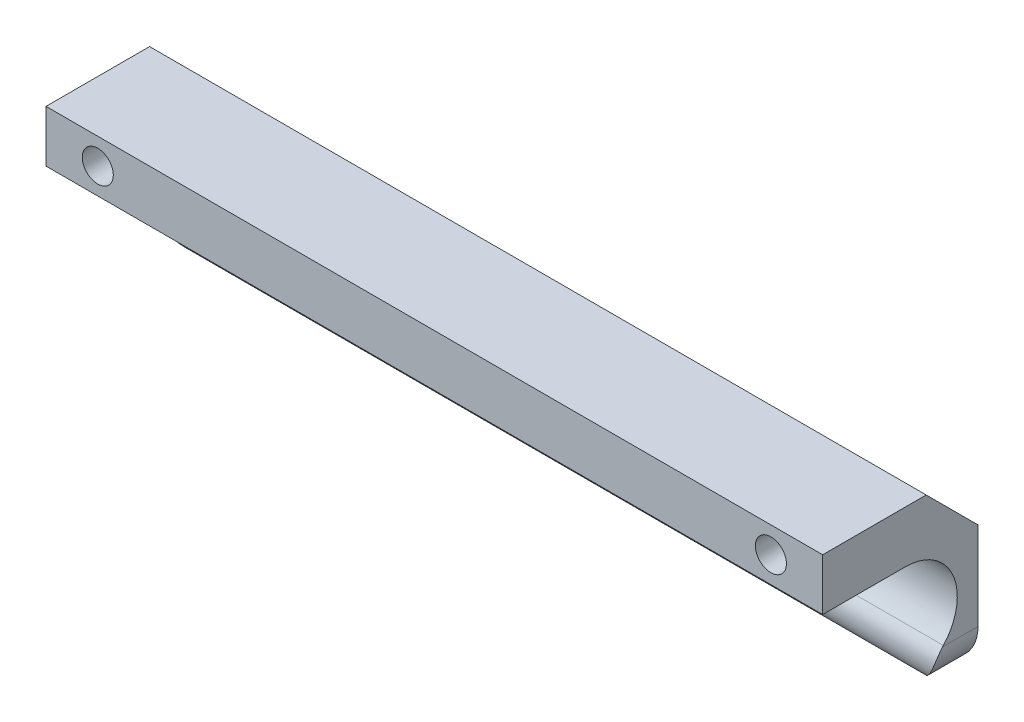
ISO-10303-21;
HEADER;
FILE_DESCRIPTION(('STEP AP214'),'2;1');
FILE_NAME('part.step','',(''),(''),'','','');
FILE_SCHEMA(('AUTOMOTIVE_DESIGN { 1 0 10303 214 1 1 1 1 }'));
ENDSEC;
DATA;
#1=APPLICATION_CONTEXT('core data for automotive mechanical design processes');
#2=APPLICATION_PROTOCOL_DEFINITION('international standard','automotive_design',2000,#1);
#3=PRODUCT_CONTEXT('',#1,'mechanical');
#4=PRODUCT('Part','Part','',(#3));
#5=PRODUCT_RELATED_PRODUCT_CATEGORY('part','',(#4));
#6=PRODUCT_DEFINITION_FORMATION('','',#4);
#7=PRODUCT_DEFINITION_CONTEXT('part definition',#1,'design');
#8=PRODUCT_DEFINITION('design','',#6,#7);
#9=PRODUCT_DEFINITION_SHAPE('','',#8);
#10=(LENGTH_UNIT() NAMED_UNIT(*) SI_UNIT(.MILLI.,.METRE.));
#11=(NAMED_UNIT(*) PLANE_ANGLE_UNIT() SI_UNIT($,.RADIAN.));
#12=(NAMED_UNIT(*) SI_UNIT($,.STERADIAN.) SOLID_ANGLE_UNIT());
#13=UNCERTAINTY_MEASURE_WITH_UNIT(LENGTH_MEASURE(1.E-05),#10,'distance_accuracy_value','');
#14=(GEOMETRIC_REPRESENTATION_CONTEXT(3) GLOBAL_UNCERTAINTY_ASSIGNED_CONTEXT((#13)) GLOBAL_UNIT_ASSIGNED_CONTEXT((#10,
#11,#12)) REPRESENTATION_CONTEXT('',''));
#15=CARTESIAN_POINT('',(0.,0.,0.));
#16=DIRECTION('',(0.,0.,1.));
#17=DIRECTION('',(1.,0.,0.));
#18=AXIS2_PLACEMENT_3D('',#15,#16,#17);
#19=CARTESIAN_POINT('',(-75.,17.5,-15.));
#20=DIRECTION('',(-1.,0.,0.));
#21=DIRECTION('',(0.,0.,1.));
#22=AXIS2_PLACEMENT_3D('',#19,#20,#21);
#23=PLANE('',#22);
#24=DIRECTION('',(0.,1.,0.));
#25=VECTOR('',#24,1.);
#26=CARTESIAN_POINT('',(-75.,-17.5,-15.));
#27=LINE('',#26,#25);
#28=CARTESIAN_POINT('',(-75.,-9.5,-15.));
#29=VERTEX_POINT('',#28);
#30=CARTESIAN_POINT('',(-75.,7.50000000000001,-15.));
#31=VERTEX_POINT('',#30);
#32=EDGE_CURVE('E204',#29,#31,#27,.T.);
#33=ORIENTED_EDGE('',*,*,#32,.F.);
#34=DIRECTION('',(0.,0.,-1.));
#35=VECTOR('',#34,1.);
#36=CARTESIAN_POINT('',(-75.,-9.5,15.));
#37=LINE('',#36,#35);
#38=CARTESIAN_POINT('',(-75.,-9.5,-8.15302564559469));
#39=VERTEX_POINT('',#38);
#40=EDGE_CURVE('E163',#39,#29,#37,.T.);
#41=ORIENTED_EDGE('',*,*,#40,.F.);
#42=CARTESIAN_POINT('',(-75.,-12.642135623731,-11.857864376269));
#43=DIRECTION('',(1.,0.,0.));
#44=DIRECTION('',(0.,0.,-1.));
#45=AXIS2_PLACEMENT_3D('',#42,#43,#44);
#46=CIRCLE('',#45,4.85786437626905);
#47=CARTESIAN_POINT('',(-75.,-9.32610593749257,-8.30782305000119));
#48=VERTEX_POINT('',#47);
#49=EDGE_CURVE('E177',#48,#39,#46,.T.);
#50=ORIENTED_EDGE('',*,*,#49,.F.);
#51=CARTESIAN_POINT('',(-75.,-2.5,-0.999999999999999));
#52=DIRECTION('',(1.,0.,0.));
#53=DIRECTION('',(0.,0.,-1.));
#54=AXIS2_PLACEMENT_3D('',#51,#52,#53);
#55=CIRCLE('',#54,10.);
#56=CARTESIAN_POINT('',(-75.,7.5,-1.));
#57=VERTEX_POINT('',#56);
#58=EDGE_CURVE('E181',#48,#57,#55,.T.);
#59=ORIENTED_EDGE('',*,*,#58,.T.);
#60=DIRECTION('',(0.,0.,1.));
#61=VECTOR('',#60,1.);
#62=CARTESIAN_POINT('',(-75.,7.5,-35.9970345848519));
#63=LINE('',#62,#61);
#64=CARTESIAN_POINT('',(-75.,7.5,15.));
#65=VERTEX_POINT('',#64);
#66=EDGE_CURVE('E186',#57,#65,#63,.T.);
#67=ORIENTED_EDGE('',*,*,#66,.T.);
#68=DIRECTION('',(0.,-1.,0.));
#69=VECTOR('',#68,1.);
#70=CARTESIAN_POINT('',(-75.,-17.5,15.));
#71=LINE('',#70,#69);
#72=CARTESIAN_POINT('',(-75.,17.5,15.));
#73=VERTEX_POINT('',#72);
#74=EDGE_CURVE('E213',#73,#65,#71,.T.);
#75=ORIENTED_EDGE('',*,*,#74,.F.);
#76=DIRECTION('',(0.,0.,1.));
#77=VECTOR('',#76,1.);
#78=CARTESIAN_POINT('',(-75.,17.5,15.));
#79=LINE('',#78,#77);
#80=CARTESIAN_POINT('',(-75.,17.5,-5.00000000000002));
#81=VERTEX_POINT('',#80);
#82=EDGE_CURVE('E223',#81,#73,#79,.T.);
#83=ORIENTED_EDGE('',*,*,#82,.F.);
#84=DIRECTION('',(0.,0.707106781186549,0.707106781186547));
#85=VECTOR('',#84,1.);
#86=CARTESIAN_POINT('',(-75.,12.5,-10.));
#87=LINE('',#86,#85);
#88=EDGE_CURVE('E236',#81,#31,#87,.F.);
#89=ORIENTED_EDGE('',*,*,#88,.T.);
#90=EDGE_LOOP('',(#33,#41,#50,#59,#67,#75,#83,#89));
#91=FACE_BOUND('',#90,.T.);
#92=ADVANCED_FACE('F37',(#91),#23,.T.);
#93=CARTESIAN_POINT('',(75.,17.5,-15.));
#94=DIRECTION('',(-1.,0.,0.));
#95=DIRECTION('',(0.,0.,1.));
#96=AXIS2_PLACEMENT_3D('',#93,#94,#95);
#97=PLANE('',#96);
#98=DIRECTION('',(0.,0.,-1.));
#99=VECTOR('',#98,1.);
#100=CARTESIAN_POINT('',(75.,-9.5,15.));
#101=LINE('',#100,#99);
#102=CARTESIAN_POINT('',(75.,-9.5,-8.15302564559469));
#103=VERTEX_POINT('',#102);
#104=CARTESIAN_POINT('',(75.,-9.5,-15.));
#105=VERTEX_POINT('',#104);
#106=EDGE_CURVE('E169',#103,#105,#101,.T.);
#107=ORIENTED_EDGE('',*,*,#106,.T.);
#108=DIRECTION('',(0.,1.,0.));
#109=VECTOR('',#108,1.);
#110=CARTESIAN_POINT('',(75.,-17.5,-15.));
#111=LINE('',#110,#109);
#112=CARTESIAN_POINT('',(75.,7.49999999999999,-15.));
#113=VERTEX_POINT('',#112);
#114=EDGE_CURVE('E209',#105,#113,#111,.T.);
#115=ORIENTED_EDGE('',*,*,#114,.T.);
#116=DIRECTION('',(0.,-0.707106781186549,-0.707106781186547));
#117=VECTOR('',#116,1.);
#118=CARTESIAN_POINT('',(75.,17.5,-5.00000000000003));
#119=LINE('',#118,#117);
#120=CARTESIAN_POINT('',(75.,17.5,-5.00000000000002));
#121=VERTEX_POINT('',#120);
#122=EDGE_CURVE('E244',#113,#121,#119,.F.);
#123=ORIENTED_EDGE('',*,*,#122,.T.);
#124=DIRECTION('',(0.,0.,1.));
#125=VECTOR('',#124,1.);
#126=CARTESIAN_POINT('',(75.,17.5,15.));
#127=LINE('',#126,#125);
#128=CARTESIAN_POINT('',(75.,17.5,15.));
#129=VERTEX_POINT('',#128);
#130=EDGE_CURVE('E212',#121,#129,#127,.T.);
#131=ORIENTED_EDGE('',*,*,#130,.T.);
#132=DIRECTION('',(0.,-1.,0.));
#133=VECTOR('',#132,1.);
#134=CARTESIAN_POINT('',(75.,-17.5,15.));
#135=LINE('',#134,#133);
#136=CARTESIAN_POINT('',(75.,7.5,15.));
#137=VERTEX_POINT('',#136);
#138=EDGE_CURVE('E216',#129,#137,#135,.T.);
#139=ORIENTED_EDGE('',*,*,#138,.T.);
#140=DIRECTION('',(0.,0.,1.));
#141=VECTOR('',#140,1.);
#142=CARTESIAN_POINT('',(75.,7.5,-35.9970345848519));
#143=LINE('',#142,#141);
#144=CARTESIAN_POINT('',(75.,7.5,-1.));
#145=VERTEX_POINT('',#144);
#146=EDGE_CURVE('E182',#145,#137,#143,.T.);
#147=ORIENTED_EDGE('',*,*,#146,.F.);
#148=CARTESIAN_POINT('',(75.,-2.5,-0.999999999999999));
#149=DIRECTION('',(1.,0.,0.));
#150=DIRECTION('',(0.,0.,-1.));
#151=AXIS2_PLACEMENT_3D('',#148,#149,#150);
#152=CIRCLE('',#151,10.);
#153=CARTESIAN_POINT('',(75.,-9.32610593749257,-8.30782305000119));
#154=VERTEX_POINT('',#153);
#155=EDGE_CURVE('E194',#154,#145,#152,.T.);
#156=ORIENTED_EDGE('',*,*,#155,.F.);
#157=CARTESIAN_POINT('',(75.,-12.642135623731,-11.857864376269));
#158=DIRECTION('',(1.,0.,0.));
#159=DIRECTION('',(0.,0.,-1.));
#160=AXIS2_PLACEMENT_3D('',#157,#158,#159);
#161=CIRCLE('',#160,4.85786437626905);
#162=EDGE_CURVE('E176',#154,#103,#161,.T.);
#163=ORIENTED_EDGE('',*,*,#162,.T.);
#164=EDGE_LOOP('',(#107,#115,#123,#131,#139,#147,#156,#163));
#165=FACE_BOUND('',#164,.T.);
#166=ADVANCED_FACE('F268',(#165),#97,.F.);
#167=CARTESIAN_POINT('',(75.,-17.5,-15.));
#168=DIRECTION('',(0.,0.,1.));
#169=DIRECTION('',(1.,0.,0.));
#170=AXIS2_PLACEMENT_3D('',#167,#168,#169);
#171=PLANE('',#170);
#172=DIRECTION('',(1.,0.,0.));
#173=VECTOR('',#172,1.);
#174=CARTESIAN_POINT('',(-75.,-16.3469743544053,-15.));
#175=LINE('',#174,#173);
#176=CARTESIAN_POINT('',(-71.1375043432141,-16.3469743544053,-15.));
#177=VERTEX_POINT('',#176);
#178=CARTESIAN_POINT('',(71.1375043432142,-16.3469743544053,-15.));
#179=VERTEX_POINT('',#178);
#180=EDGE_CURVE('E173',#177,#179,#175,.T.);
#181=ORIENTED_EDGE('',*,*,#180,.F.);
#182=CARTESIAN_POINT('',(-67.,-9.5,-15.));
#183=DIRECTION('',(0.,0.,1.));
#184=DIRECTION('',(-1.,0.,0.));
#185=AXIS2_PLACEMENT_3D('',#182,#183,#184);
#186=CIRCLE('',#185,7.99999999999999);
#187=EDGE_CURVE('E160',#29,#177,#186,.T.);
#188=ORIENTED_EDGE('',*,*,#187,.F.);
#189=ORIENTED_EDGE('',*,*,#32,.T.);
#190=DIRECTION('',(1.,0.,0.));
#191=VECTOR('',#190,1.);
#192=CARTESIAN_POINT('',(75.,7.50000000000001,-15.));
#193=LINE('',#192,#191);
#194=EDGE_CURVE('E240',#31,#113,#193,.T.);
#195=ORIENTED_EDGE('',*,*,#194,.T.);
#196=ORIENTED_EDGE('',*,*,#114,.F.);
#197=CARTESIAN_POINT('',(67.,-9.5,-15.));
#198=DIRECTION('',(0.,0.,1.));
#199=DIRECTION('',(-1.,0.,0.));
#200=AXIS2_PLACEMENT_3D('',#197,#198,#199);
#201=CIRCLE('',#200,8.);
#202=EDGE_CURVE('E166',#179,#105,#201,.T.);
#203=ORIENTED_EDGE('',*,*,#202,.F.);
#204=EDGE_LOOP('',(#181,#188,#189,#195,#196,#203));
#205=FACE_BOUND('',#204,.T.);
#206=ADVANCED_FACE('F315',(#205),#171,.F.);
#207=CARTESIAN_POINT('',(75.,17.5,15.));
#208=DIRECTION('',(0.,-1.,0.));
#209=DIRECTION('',(0.,0.,-1.));
#210=AXIS2_PLACEMENT_3D('',#207,#208,#209);
#211=PLANE('',#210);
#212=ORIENTED_EDGE('',*,*,#130,.F.);
#213=DIRECTION('',(-1.,0.,0.));
#214=VECTOR('',#213,1.);
#215=CARTESIAN_POINT('',(75.,17.5,-5.00000000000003));
#216=LINE('',#215,#214);
#217=EDGE_CURVE('E232',#121,#81,#216,.T.);
#218=ORIENTED_EDGE('',*,*,#217,.T.);
#219=ORIENTED_EDGE('',*,*,#82,.T.);
#220=DIRECTION('',(-1.,0.,0.));
#221=VECTOR('',#220,1.);
#222=CARTESIAN_POINT('',(75.,17.5,15.));
#223=LINE('',#222,#221);
#224=EDGE_CURVE('E220',#129,#73,#223,.T.);
#225=ORIENTED_EDGE('',*,*,#224,.F.);
#226=EDGE_LOOP('',(#212,#218,#219,#225));
#227=FACE_BOUND('',#226,.T.);
#228=ADVANCED_FACE('F322',(#227),#211,.F.);
#229=CARTESIAN_POINT('',(75.,-17.5,15.));
#230=DIRECTION('',(0.,0.,-1.));
#231=DIRECTION('',(-1.,0.,0.));
#232=AXIS2_PLACEMENT_3D('',#229,#230,#231);
#233=PLANE('',#232);
#234=CARTESIAN_POINT('',(65.,12.5,15.));
#235=DIRECTION('',(0.,0.,1.));
#236=DIRECTION('',(1.,0.,0.));
#237=AXIS2_PLACEMENT_3D('',#234,#235,#236);
#238=CIRCLE('',#237,3.);
#239=CARTESIAN_POINT('',(68.,12.5,15.));
#240=VERTEX_POINT('',#239);
#241=EDGE_CURVE('E354',#240,#240,#238,.T.);
#242=ORIENTED_EDGE('',*,*,#241,.F.);
#243=EDGE_LOOP('',(#242));
#244=FACE_BOUND('',#243,.T.);
#245=CARTESIAN_POINT('',(-65.,12.5,15.));
#246=DIRECTION('',(0.,0.,1.));
#247=DIRECTION('',(1.,0.,0.));
#248=AXIS2_PLACEMENT_3D('',#245,#246,#247);
#249=CIRCLE('',#248,3.);
#250=CARTESIAN_POINT('',(-62.,12.5,15.));
#251=VERTEX_POINT('',#250);
#252=EDGE_CURVE('E134',#251,#251,#249,.T.);
#253=ORIENTED_EDGE('',*,*,#252,.F.);
#254=EDGE_LOOP('',(#253));
#255=FACE_BOUND('',#254,.T.);
#256=ORIENTED_EDGE('',*,*,#74,.T.);
#257=DIRECTION('',(1.,0.,0.));
#258=VECTOR('',#257,1.);
#259=CARTESIAN_POINT('',(-75.,7.5,15.));
#260=LINE('',#259,#258);
#261=EDGE_CURVE('E200',#65,#137,#260,.T.);
#262=ORIENTED_EDGE('',*,*,#261,.T.);
#263=ORIENTED_EDGE('',*,*,#138,.F.);
#264=ORIENTED_EDGE('',*,*,#224,.T.);
#265=EDGE_LOOP('',(#256,#262,#263,#264));
#266=FACE_BOUND('',#265,.T.);
#267=ADVANCED_FACE('F319',(#244,#255,#266),#233,.F.);
#268=CARTESIAN_POINT('',(75.,17.5,-5.00000000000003));
#269=DIRECTION('',(0.,-0.707106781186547,0.707106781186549));
#270=DIRECTION('',(0.,-0.707106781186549,-0.707106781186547));
#271=AXIS2_PLACEMENT_3D('',#268,#269,#270);
#272=PLANE('',#271);
#273=ORIENTED_EDGE('',*,*,#122,.F.);
#274=ORIENTED_EDGE('',*,*,#194,.F.);
#275=ORIENTED_EDGE('',*,*,#88,.F.);
#276=ORIENTED_EDGE('',*,*,#217,.F.);
#277=EDGE_LOOP('',(#273,#274,#275,#276));
#278=FACE_BOUND('',#277,.T.);
#279=ADVANCED_FACE('F39',(#278),#272,.F.);
#280=CARTESIAN_POINT('',(-75.,-12.642135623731,-11.857864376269));
#281=DIRECTION('',(1.,0.,0.));
#282=DIRECTION('',(0.,0.,-1.));
#283=AXIS2_PLACEMENT_3D('',#280,#281,#282);
#284=CYLINDRICAL_SURFACE('',#283,4.85786437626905);
#285=CARTESIAN_POINT('',(-71.1375043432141,-16.3469743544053,-15.));
#286=CARTESIAN_POINT('',(-71.026149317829,-16.4142592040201,-14.9206561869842));
#287=CARTESIAN_POINT('',(-70.9139235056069,-16.4783721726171,-14.8399052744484));
#288=CARTESIAN_POINT('',(-70.6879480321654,-16.6003901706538,-14.6759350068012));
#289=CARTESIAN_POINT('',(-70.574198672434,-16.6582964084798,-14.5927161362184));
#290=CARTESIAN_POINT('',(-70.2311071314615,-16.8228592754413,-14.3399621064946));
#291=CARTESIAN_POINT('',(-69.9997446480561,-16.920466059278,-14.1672029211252));
#292=CARTESIAN_POINT('',(-69.5341663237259,-17.0920563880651,-13.8161969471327));
#293=CARTESIAN_POINT('',(-69.2999657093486,-17.1661334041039,-13.6379750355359));
#294=CARTESIAN_POINT('',(-68.8289391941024,-17.291943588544,-13.2772338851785));
#295=CARTESIAN_POINT('',(-68.5921135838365,-17.3436792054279,-13.0947151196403));
#296=CARTESIAN_POINT('',(-68.1319730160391,-17.422727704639,-12.7387085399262));
#297=CARTESIAN_POINT('',(-67.9087578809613,-17.4513858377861,-12.5653856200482));
#298=CARTESIAN_POINT('',(-67.4617109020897,-17.4898128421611,-12.2176471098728));
#299=CARTESIAN_POINT('',(-67.2378795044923,-17.4995929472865,-12.0432322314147));
#300=CARTESIAN_POINT('',(-67.0094068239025,-17.4999958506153,-11.8651946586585));
#301=CARTESIAN_POINT('',(-67.0047033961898,-17.4999999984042,-11.8615295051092));
#302=CARTESIAN_POINT('',(-67.,-17.5,-11.857864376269));
#303=B_SPLINE_CURVE_WITH_KNOTS('',3,(#285,#286,#287,#288,#289,#290,#291,#292,#293,#294,#295,
#296,#297,#298,#299,#300,#301,#302),.UNSPECIFIED.,.F.,.F.,(4,2,2,2,2,2,2,2,4),(0.,
0.457072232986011,0.914055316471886,1.82729816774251,2.73686646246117,3.64633504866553,
4.49789854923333,5.348955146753,5.3668436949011),.UNSPECIFIED.);
#304=CARTESIAN_POINT('',(-67.,-17.5,-11.857864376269));
#305=VERTEX_POINT('',#304);
#306=EDGE_CURVE('E11',#177,#305,#303,.T.);
#307=ORIENTED_EDGE('',*,*,#306,.F.);
#308=ORIENTED_EDGE('',*,*,#180,.T.);
#309=CARTESIAN_POINT('',(71.1375043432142,-16.3469743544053,-15.));
#310=CARTESIAN_POINT('',(71.026149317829,-16.4142592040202,-14.9206561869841));
#311=CARTESIAN_POINT('',(70.9139235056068,-16.4783721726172,-14.8399052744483));
#312=CARTESIAN_POINT('',(70.6879480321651,-16.6003901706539,-14.675935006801));
#313=CARTESIAN_POINT('',(70.5741986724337,-16.65829640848,-14.5927161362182));
#314=CARTESIAN_POINT('',(70.231107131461,-16.8228592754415,-14.3399621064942));
#315=CARTESIAN_POINT('',(69.9997446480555,-16.9204660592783,-14.1672029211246));
#316=CARTESIAN_POINT('',(69.5341663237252,-17.0920563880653,-13.8161969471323));
#317=CARTESIAN_POINT('',(69.2999657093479,-17.1661334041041,-13.6379750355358));
#318=CARTESIAN_POINT('',(68.8289391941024,-17.2919435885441,-13.2772338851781));
#319=CARTESIAN_POINT('',(68.5921135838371,-17.3436792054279,-13.0947151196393));
#320=CARTESIAN_POINT('',(68.1319730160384,-17.422727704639,-12.738708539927));
#321=CARTESIAN_POINT('',(67.9087578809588,-17.4513858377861,-12.5653856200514));
#322=CARTESIAN_POINT('',(67.4617109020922,-17.4898128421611,-12.2176471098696));
#323=CARTESIAN_POINT('',(67.2378795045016,-17.4995929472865,-12.0432322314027));
#324=CARTESIAN_POINT('',(67.0094068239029,-17.4999958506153,-11.865194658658));
#325=CARTESIAN_POINT('',(67.00470339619,-17.4999999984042,-11.8615295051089));
#326=CARTESIAN_POINT('',(67.,-17.5,-11.857864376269));
#327=B_SPLINE_CURVE_WITH_KNOTS('',3,(#309,#310,#311,#312,#313,#314,#315,#316,#317,#318,#319,
#320,#321,#322,#323,#324,#325,#326),.UNSPECIFIED.,.F.,.F.,(4,2,2,2,2,2,2,2,4),(0.,
0.457072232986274,0.914055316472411,1.82729816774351,2.73686646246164,3.64633504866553,
4.49789854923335,5.34895514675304,5.36684369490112),.UNSPECIFIED.);
#328=CARTESIAN_POINT('',(67.,-17.5,-11.857864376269));
#329=VERTEX_POINT('',#328);
#330=EDGE_CURVE('E247',#329,#179,#327,.F.);
#331=ORIENTED_EDGE('',*,*,#330,.F.);
#332=CARTESIAN_POINT('',(75.,-9.5,-8.15302564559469));
#333=CARTESIAN_POINT('',(75.0000097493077,-9.59352523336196,-8.07368202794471));
#334=CARTESIAN_POINT('',(74.9983604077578,-9.69008993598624,-7.99789663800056));
#335=CARTESIAN_POINT('',(74.9911711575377,-9.88859852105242,-7.85388207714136));
#336=CARTESIAN_POINT('',(74.9856301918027,-9.99054385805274,-7.78565496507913));
#337=CARTESIAN_POINT('',(74.9700913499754,-10.198972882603,-7.65729543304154));
#338=CARTESIAN_POINT('',(74.9600973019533,-10.3054526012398,-7.59715611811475));
#339=CARTESIAN_POINT('',(74.9351784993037,-10.52217077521,-7.48528386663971));
#340=CARTESIAN_POINT('',(74.9202543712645,-10.6324087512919,-7.43354986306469));
#341=CARTESIAN_POINT('',(74.8850588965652,-10.8559787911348,-7.33865317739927));
#342=CARTESIAN_POINT('',(74.8647759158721,-10.9693170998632,-7.29550950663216));
#343=CARTESIAN_POINT('',(74.8186122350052,-11.1979113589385,-7.21807659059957));
#344=CARTESIAN_POINT('',(74.7927294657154,-11.3131680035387,-7.1837906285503));
#345=CARTESIAN_POINT('',(74.735281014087,-11.5444077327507,-7.12414698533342));
#346=CARTESIAN_POINT('',(74.703722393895,-11.6603897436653,-7.09877832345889));
#347=CARTESIAN_POINT('',(74.6348944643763,-11.8922834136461,-7.05677505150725));
#348=CARTESIAN_POINT('',(74.5976230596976,-12.0081950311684,-7.04014365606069));
#349=CARTESIAN_POINT('',(74.51821752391,-12.2369330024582,-7.01558661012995));
#350=CARTESIAN_POINT('',(74.4761815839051,-12.34977757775,-7.00751149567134));
#351=CARTESIAN_POINT('',(74.386927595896,-12.5737336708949,-6.99918860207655));
#352=CARTESIAN_POINT('',(74.3397075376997,-12.6848444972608,-6.99894387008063));
#353=CARTESIAN_POINT('',(74.2403552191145,-12.9046752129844,-7.00585245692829));
#354=CARTESIAN_POINT('',(74.1882203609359,-13.0133938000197,-7.01300970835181));
#355=CARTESIAN_POINT('',(74.0793844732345,-13.2278389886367,-7.03423365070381));
#356=CARTESIAN_POINT('',(74.0226824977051,-13.3335649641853,-7.04830177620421));
#357=CARTESIAN_POINT('',(73.8837240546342,-13.5793186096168,-7.08909377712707));
#358=CARTESIAN_POINT('',(73.7996590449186,-13.7178767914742,-7.11855734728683));
#359=CARTESIAN_POINT('',(73.6246176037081,-13.9877993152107,-7.18801715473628));
#360=CARTESIAN_POINT('',(73.5336391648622,-14.1191615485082,-7.22801645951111));
#361=CARTESIAN_POINT('',(73.34555598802,-14.3743273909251,-7.31730842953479));
#362=CARTESIAN_POINT('',(73.2484445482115,-14.4981224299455,-7.36661138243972));
#363=CARTESIAN_POINT('',(73.0489770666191,-14.7377664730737,-7.47330173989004));
#364=CARTESIAN_POINT('',(72.9466195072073,-14.8536131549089,-7.53069149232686));
#365=CARTESIAN_POINT('',(72.6981722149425,-15.11917656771,-7.67530997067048));
#366=CARTESIAN_POINT('',(72.5500680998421,-15.2653178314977,-7.76566141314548));
#367=CARTESIAN_POINT('',(72.2469870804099,-15.5424592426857,-7.95717871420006));
#368=CARTESIAN_POINT('',(72.0920104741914,-15.6734600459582,-8.05834410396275));
#369=CARTESIAN_POINT('',(71.776167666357,-15.9209458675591,-8.2697202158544));
#370=CARTESIAN_POINT('',(71.615290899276,-16.0374030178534,-8.37994765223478));
#371=CARTESIAN_POINT('',(71.2890167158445,-16.2559526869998,-8.60762234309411));
#372=CARTESIAN_POINT('',(71.1236192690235,-16.3580451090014,-8.72506964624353));
#373=CARTESIAN_POINT('',(70.7251962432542,-16.5847491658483,-9.01187498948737));
#374=CARTESIAN_POINT('',(70.4904917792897,-16.7030468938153,-9.18391192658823));
#375=CARTESIAN_POINT('',(70.015925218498,-16.9142900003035,-9.53627860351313));
#376=CARTESIAN_POINT('',(69.7760611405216,-17.0072254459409,-9.7166115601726));
#377=CARTESIAN_POINT('',(69.2929259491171,-17.1685898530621,-10.0830184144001));
#378=CARTESIAN_POINT('',(69.0496584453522,-17.2370429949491,-10.2690864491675));
#379=CARTESIAN_POINT('',(68.5608069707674,-17.3502768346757,-10.6450941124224));
#380=CARTESIAN_POINT('',(68.3152234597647,-17.3950621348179,-10.8350329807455));
#381=CARTESIAN_POINT('',(67.7182200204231,-17.4755446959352,-11.2982018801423));
#382=CARTESIAN_POINT('',(67.3660106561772,-17.4993671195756,-11.5726501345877));
#383=CARTESIAN_POINT('',(67.0094067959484,-17.4999958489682,-11.8505341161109));
#384=CARTESIAN_POINT('',(67.0047033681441,-17.4999999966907,-11.8541992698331));
#385=CARTESIAN_POINT('',(67.,-17.5,-11.857864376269));
#386=B_SPLINE_CURVE_WITH_KNOTS('',3,(#332,#333,#334,#335,#336,#337,#338,#339,#340,#341,#342,
#343,#344,#345,#346,#347,#348,#349,#350,#351,#352,#353,#354,#355,#356,#357,#358,#359,#360,#361,
#362,#363,#364,#365,#366,#367,#368,#369,#370,#371,#372,#373,#374,#375,#376,#377,#378,#379,#380,
#381,#382,#383,#384,#385),.UNSPECIFIED.,.F.,.F.,(4,2,2,2,2,2,2,2,2,2,2,2,2,2,2,2,2,2,2,2,2,2,2,
2,2,2,4),(0.,0.3678669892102,0.735833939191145,1.10348517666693,1.47108970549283,
1.83949895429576,2.2080445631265,2.57613474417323,2.94436025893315,3.30604174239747,
3.66786397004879,4.02987852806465,4.391968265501,4.88540779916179,5.37899115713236,
5.87312353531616,6.36739967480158,7.04689686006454,7.72636459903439,8.40711495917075,
9.08786990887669,10.028900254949,10.9702986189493,11.9107646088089,12.8510476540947,
14.189414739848,14.2073032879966),.UNSPECIFIED.);
#387=EDGE_CURVE('E64',#103,#329,#386,.T.);
#388=ORIENTED_EDGE('',*,*,#387,.F.);
#389=ORIENTED_EDGE('',*,*,#162,.F.);
#390=DIRECTION('',(1.,0.,0.));
#391=VECTOR('',#390,1.);
#392=CARTESIAN_POINT('',(-75.,-9.32610593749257,-8.30782305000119));
#393=LINE('',#392,#391);
#394=EDGE_CURVE('E190',#48,#154,#393,.T.);
#395=ORIENTED_EDGE('',*,*,#394,.F.);
#396=ORIENTED_EDGE('',*,*,#49,.T.);
#397=CARTESIAN_POINT('',(-75.,-9.5,-8.15302564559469));
#398=CARTESIAN_POINT('',(-75.0000097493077,-9.59352523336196,-8.07368202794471));
#399=CARTESIAN_POINT('',(-74.9983604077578,-9.69008993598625,-7.99789663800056));
#400=CARTESIAN_POINT('',(-74.9911711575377,-9.88859852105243,-7.85388207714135));
#401=CARTESIAN_POINT('',(-74.9856301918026,-9.99054385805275,-7.78565496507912));
#402=CARTESIAN_POINT('',(-74.9700913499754,-10.198972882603,-7.65729543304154));
#403=CARTESIAN_POINT('',(-74.9600973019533,-10.3054526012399,-7.59715611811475));
#404=CARTESIAN_POINT('',(-74.9351784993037,-10.52217077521,-7.4852838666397));
#405=CARTESIAN_POINT('',(-74.9202543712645,-10.6324087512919,-7.43354986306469));
#406=CARTESIAN_POINT('',(-74.8850588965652,-10.8559787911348,-7.33865317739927));
#407=CARTESIAN_POINT('',(-74.8647759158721,-10.9693170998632,-7.29550950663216));
#408=CARTESIAN_POINT('',(-74.8186122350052,-11.1979113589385,-7.21807659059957));
#409=CARTESIAN_POINT('',(-74.7927294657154,-11.3131680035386,-7.1837906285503));
#410=CARTESIAN_POINT('',(-74.735281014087,-11.5444077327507,-7.12414698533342));
#411=CARTESIAN_POINT('',(-74.703722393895,-11.6603897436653,-7.09877832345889));
#412=CARTESIAN_POINT('',(-74.6348944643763,-11.8922834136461,-7.05677505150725));
#413=CARTESIAN_POINT('',(-74.5976230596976,-12.0081950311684,-7.04014365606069));
#414=CARTESIAN_POINT('',(-74.51821752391,-12.2369330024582,-7.01558661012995));
#415=CARTESIAN_POINT('',(-74.4761815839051,-12.34977757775,-7.00751149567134));
#416=CARTESIAN_POINT('',(-74.386927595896,-12.5737336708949,-6.99918860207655));
#417=CARTESIAN_POINT('',(-74.3397075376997,-12.6848444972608,-6.99894387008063));
#418=CARTESIAN_POINT('',(-74.2403552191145,-12.9046752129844,-7.00585245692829));
#419=CARTESIAN_POINT('',(-74.1882203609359,-13.0133938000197,-7.01300970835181));
#420=CARTESIAN_POINT('',(-74.0793844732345,-13.2278389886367,-7.03423365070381));
#421=CARTESIAN_POINT('',(-74.0226824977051,-13.3335649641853,-7.04830177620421));
#422=CARTESIAN_POINT('',(-73.8837240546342,-13.5793186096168,-7.08909377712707));
#423=CARTESIAN_POINT('',(-73.7996590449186,-13.7178767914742,-7.11855734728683));
#424=CARTESIAN_POINT('',(-73.6246176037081,-13.9877993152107,-7.18801715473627));
#425=CARTESIAN_POINT('',(-73.5336391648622,-14.1191615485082,-7.2280164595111));
#426=CARTESIAN_POINT('',(-73.3455559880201,-14.3743273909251,-7.31730842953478));
#427=CARTESIAN_POINT('',(-73.2484445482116,-14.4981224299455,-7.36661138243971));
#428=CARTESIAN_POINT('',(-73.0489770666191,-14.7377664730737,-7.47330173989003));
#429=CARTESIAN_POINT('',(-72.9466195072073,-14.8536131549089,-7.53069149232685));
#430=CARTESIAN_POINT('',(-72.6981722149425,-15.11917656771,-7.67530997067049));
#431=CARTESIAN_POINT('',(-72.5500680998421,-15.2653178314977,-7.7656614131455));
#432=CARTESIAN_POINT('',(-72.2469870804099,-15.5424592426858,-7.9571787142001));
#433=CARTESIAN_POINT('',(-72.0920104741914,-15.6734600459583,-8.0583441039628));
#434=CARTESIAN_POINT('',(-71.7761676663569,-15.9209458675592,-8.26972021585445));
#435=CARTESIAN_POINT('',(-71.6152908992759,-16.0374030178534,-8.37994765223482));
#436=CARTESIAN_POINT('',(-71.2890167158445,-16.2559526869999,-8.60762234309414));
#437=CARTESIAN_POINT('',(-71.1236192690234,-16.3580451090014,-8.72506964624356));
#438=CARTESIAN_POINT('',(-70.7251962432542,-16.5847491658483,-9.01187498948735));
#439=CARTESIAN_POINT('',(-70.4904917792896,-16.7030468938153,-9.18391192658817));
#440=CARTESIAN_POINT('',(-70.0159252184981,-16.9142900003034,-9.53627860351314));
#441=CARTESIAN_POINT('',(-69.7760611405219,-17.0072254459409,-9.71661156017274));
#442=CARTESIAN_POINT('',(-69.2929259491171,-17.168589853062,-10.0830184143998));
#443=CARTESIAN_POINT('',(-69.0496584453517,-17.2370429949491,-10.2690864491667));
#444=CARTESIAN_POINT('',(-68.560806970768,-17.3502768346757,-10.6450941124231));
#445=CARTESIAN_POINT('',(-68.3152234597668,-17.3950621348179,-10.8350329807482));
#446=CARTESIAN_POINT('',(-67.7182200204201,-17.4755446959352,-11.2982018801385));
#447=CARTESIAN_POINT('',(-67.3660106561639,-17.4993671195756,-11.5726501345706));
#448=CARTESIAN_POINT('',(-67.009406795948,-17.4999958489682,-11.8505341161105));
#449=CARTESIAN_POINT('',(-67.0047033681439,-17.4999999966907,-11.8541992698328));
#450=CARTESIAN_POINT('',(-67.,-17.5,-11.857864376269));
#451=B_SPLINE_CURVE_WITH_KNOTS('',3,(#397,#398,#399,#400,#401,#402,#403,#404,#405,#406,#407,
#408,#409,#410,#411,#412,#413,#414,#415,#416,#417,#418,#419,#420,#421,#422,#423,#424,#425,#426,
#427,#428,#429,#430,#431,#432,#433,#434,#435,#436,#437,#438,#439,#440,#441,#442,#443,#444,#445,
#446,#447,#448,#449,#450),.UNSPECIFIED.,.F.,.F.,(4,2,2,2,2,2,2,2,2,2,2,2,2,2,2,2,2,2,2,2,2,2,2,
2,2,2,4),(0.,0.367866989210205,0.735833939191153,1.10348517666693,1.47108970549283,
1.83949895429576,2.20804456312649,2.57613474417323,2.94436025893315,3.30604174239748,
3.6678639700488,4.02987852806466,4.391968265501,4.88540779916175,5.37899115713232,
5.87312353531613,6.36739967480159,7.0468968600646,7.72636459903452,8.40711495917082,
9.08786990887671,10.028900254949,10.9702986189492,11.9107646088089,12.8510476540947,
14.189414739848,14.2073032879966),.UNSPECIFIED.);
#452=EDGE_CURVE('E51',#305,#39,#451,.F.);
#453=ORIENTED_EDGE('',*,*,#452,.F.);
#454=EDGE_LOOP('',(#307,#308,#331,#388,#389,#395,#396,#453));
#455=FACE_BOUND('',#454,.T.);
#456=ADVANCED_FACE('F260',(#455),#284,.T.);
#457=CARTESIAN_POINT('',(-75.,7.5,-35.9970345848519));
#458=DIRECTION('',(0.,1.,0.));
#459=DIRECTION('',(0.,0.,1.));
#460=AXIS2_PLACEMENT_3D('',#457,#458,#459);
#461=PLANE('',#460);
#462=ORIENTED_EDGE('',*,*,#146,.T.);
#463=ORIENTED_EDGE('',*,*,#261,.F.);
#464=ORIENTED_EDGE('',*,*,#66,.F.);
#465=DIRECTION('',(1.,0.,0.));
#466=VECTOR('',#465,1.);
#467=CARTESIAN_POINT('',(-75.,7.5,-1.));
#468=LINE('',#467,#466);
#469=EDGE_CURVE('E205',#57,#145,#468,.T.);
#470=ORIENTED_EDGE('',*,*,#469,.T.);
#471=EDGE_LOOP('',(#462,#463,#464,#470));
#472=FACE_BOUND('',#471,.T.);
#473=ADVANCED_FACE('F265',(#472),#461,.F.);
#474=CARTESIAN_POINT('',(-75.,-2.5,-0.999999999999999));
#475=DIRECTION('',(1.,0.,0.));
#476=DIRECTION('',(0.,0.,-1.));
#477=AXIS2_PLACEMENT_3D('',#474,#475,#476);
#478=CYLINDRICAL_SURFACE('',#477,10.);
#479=ORIENTED_EDGE('',*,*,#155,.T.);
#480=ORIENTED_EDGE('',*,*,#469,.F.);
#481=ORIENTED_EDGE('',*,*,#58,.F.);
#482=ORIENTED_EDGE('',*,*,#394,.T.);
#483=EDGE_LOOP('',(#479,#480,#481,#482));
#484=FACE_BOUND('',#483,.T.);
#485=ADVANCED_FACE('F267',(#484),#478,.F.);
#486=CARTESIAN_POINT('',(67.,-9.5,15.));
#487=DIRECTION('',(0.,0.,-1.));
#488=DIRECTION('',(-1.,0.,0.));
#489=AXIS2_PLACEMENT_3D('',#486,#487,#488);
#490=CYLINDRICAL_SURFACE('',#489,8.);
#491=ORIENTED_EDGE('',*,*,#387,.T.);
#492=ORIENTED_EDGE('',*,*,#330,.T.);
#493=ORIENTED_EDGE('',*,*,#202,.T.);
#494=ORIENTED_EDGE('',*,*,#106,.F.);
#495=EDGE_LOOP('',(#491,#492,#493,#494));
#496=FACE_BOUND('',#495,.T.);
#497=ADVANCED_FACE('F257',(#496),#490,.T.);
#498=CARTESIAN_POINT('',(-67.,-9.5,15.));
#499=DIRECTION('',(0.,0.,-1.));
#500=DIRECTION('',(-1.,0.,0.));
#501=AXIS2_PLACEMENT_3D('',#498,#499,#500);
#502=CYLINDRICAL_SURFACE('',#501,7.99999999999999);
#503=ORIENTED_EDGE('',*,*,#306,.T.);
#504=ORIENTED_EDGE('',*,*,#452,.T.);
#505=ORIENTED_EDGE('',*,*,#40,.T.);
#506=ORIENTED_EDGE('',*,*,#187,.T.);
#507=EDGE_LOOP('',(#503,#504,#505,#506));
#508=FACE_BOUND('',#507,.T.);
#509=ADVANCED_FACE('F277',(#508),#502,.T.);
#510=CARTESIAN_POINT('',(-65.,12.5,-2.));
#511=DIRECTION('',(0.,0.,1.));
#512=DIRECTION('',(1.,0.,0.));
#513=AXIS2_PLACEMENT_3D('',#510,#511,#512);
#514=CONICAL_SURFACE('',#513,2.5,1.02974425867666);
#515=CARTESIAN_POINT('',(-65.,12.5,-3.5021515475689));
#516=VERTEX_POINT('',#515);
#517=VERTEX_LOOP('',#516);
#518=FACE_BOUND('',#517,.T.);
#519=CARTESIAN_POINT('',(-65.,12.5,-2.));
#520=DIRECTION('',(0.,0.,1.));
#521=DIRECTION('',(1.,0.,0.));
#522=AXIS2_PLACEMENT_3D('',#519,#520,#521);
#523=CIRCLE('',#522,2.5);
#524=CARTESIAN_POINT('',(-62.5,12.5,-2.));
#525=VERTEX_POINT('',#524);
#526=EDGE_CURVE('E156',#525,#525,#523,.T.);
#527=ORIENTED_EDGE('',*,*,#526,.T.);
#528=EDGE_LOOP('',(#527));
#529=FACE_BOUND('',#528,.T.);
#530=ADVANCED_FACE('F281',(#518,#529),#514,.F.);
#531=CARTESIAN_POINT('',(-65.,12.5,15.));
#532=DIRECTION('',(0.,0.,1.));
#533=DIRECTION('',(1.,0.,0.));
#534=AXIS2_PLACEMENT_3D('',#531,#532,#533);
#535=CYLINDRICAL_SURFACE('',#534,2.5);
#536=ORIENTED_EDGE('',*,*,#526,.F.);
#537=EDGE_LOOP('',(#536));
#538=FACE_BOUND('',#537,.T.);
#539=CARTESIAN_POINT('',(-65.,12.5,3.));
#540=DIRECTION('',(0.,0.,1.));
#541=DIRECTION('',(1.,0.,0.));
#542=AXIS2_PLACEMENT_3D('',#539,#540,#541);
#543=CIRCLE('',#542,2.49999999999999);
#544=CARTESIAN_POINT('',(-62.5,12.5,3.));
#545=VERTEX_POINT('',#544);
#546=EDGE_CURVE('E152',#545,#545,#543,.T.);
#547=ORIENTED_EDGE('',*,*,#546,.T.);
#548=EDGE_LOOP('',(#547));
#549=FACE_BOUND('',#548,.T.);
#550=ADVANCED_FACE('F285',(#538,#549),#535,.F.);
#551=CARTESIAN_POINT('',(-62.5,12.5,3.));
#552=DIRECTION('',(0.,0.,-1.));
#553=DIRECTION('',(-1.,0.,0.));
#554=AXIS2_PLACEMENT_3D('',#551,#552,#553);
#555=PLANE('',#554);
#556=ORIENTED_EDGE('',*,*,#546,.F.);
#557=EDGE_LOOP('',(#556));
#558=FACE_BOUND('',#557,.T.);
#559=CARTESIAN_POINT('',(-65.,12.5,3.));
#560=DIRECTION('',(0.,0.,1.));
#561=DIRECTION('',(1.,0.,0.));
#562=AXIS2_PLACEMENT_3D('',#559,#560,#561);
#563=CIRCLE('',#562,3.);
#564=CARTESIAN_POINT('',(-62.,12.5,3.));
#565=VERTEX_POINT('',#564);
#566=EDGE_CURVE('E141',#565,#565,#563,.T.);
#567=ORIENTED_EDGE('',*,*,#566,.T.);
#568=EDGE_LOOP('',(#567));
#569=FACE_BOUND('',#568,.T.);
#570=ADVANCED_FACE('F289',(#558,#569),#555,.F.);
#571=CARTESIAN_POINT('',(-65.,12.5,15.));
#572=DIRECTION('',(0.,0.,1.));
#573=DIRECTION('',(1.,0.,0.));
#574=AXIS2_PLACEMENT_3D('',#571,#572,#573);
#575=CYLINDRICAL_SURFACE('',#574,3.);
#576=ORIENTED_EDGE('',*,*,#566,.F.);
#577=EDGE_LOOP('',(#576));
#578=FACE_BOUND('',#577,.T.);
#579=ORIENTED_EDGE('',*,*,#252,.T.);
#580=EDGE_LOOP('',(#579));
#581=FACE_BOUND('',#580,.T.);
#582=ADVANCED_FACE('F127',(#578,#581),#575,.F.);
#583=CARTESIAN_POINT('',(65.,12.5,-2.));
#584=DIRECTION('',(0.,0.,1.));
#585=DIRECTION('',(1.,0.,0.));
#586=AXIS2_PLACEMENT_3D('',#583,#584,#585);
#587=CONICAL_SURFACE('',#586,2.5,1.02974425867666);
#588=CARTESIAN_POINT('',(65.,12.5,-3.5021515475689));
#589=VERTEX_POINT('',#588);
#590=VERTEX_LOOP('',#589);
#591=FACE_BOUND('',#590,.T.);
#592=CARTESIAN_POINT('',(65.,12.5,-2.));
#593=DIRECTION('',(0.,0.,1.));
#594=DIRECTION('',(1.,0.,0.));
#595=AXIS2_PLACEMENT_3D('',#592,#593,#594);
#596=CIRCLE('',#595,2.5);
#597=CARTESIAN_POINT('',(67.5,12.5,-2.));
#598=VERTEX_POINT('',#597);
#599=EDGE_CURVE('E131',#598,#598,#596,.T.);
#600=ORIENTED_EDGE('',*,*,#599,.T.);
#601=EDGE_LOOP('',(#600));
#602=FACE_BOUND('',#601,.T.);
#603=ADVANCED_FACE('F123',(#591,#602),#587,.F.);
#604=CARTESIAN_POINT('',(65.,12.5,15.));
#605=DIRECTION('',(0.,0.,1.));
#606=DIRECTION('',(1.,0.,0.));
#607=AXIS2_PLACEMENT_3D('',#604,#605,#606);
#608=CYLINDRICAL_SURFACE('',#607,2.5);
#609=ORIENTED_EDGE('',*,*,#599,.F.);
#610=EDGE_LOOP('',(#609));
#611=FACE_BOUND('',#610,.T.);
#612=CARTESIAN_POINT('',(65.,12.5,3.));
#613=DIRECTION('',(0.,0.,1.));
#614=DIRECTION('',(1.,0.,0.));
#615=AXIS2_PLACEMENT_3D('',#612,#613,#614);
#616=CIRCLE('',#615,2.49999999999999);
#617=CARTESIAN_POINT('',(67.5,12.5,3.));
#618=VERTEX_POINT('',#617);
#619=EDGE_CURVE('E135',#618,#618,#616,.T.);
#620=ORIENTED_EDGE('',*,*,#619,.T.);
#621=EDGE_LOOP('',(#620));
#622=FACE_BOUND('',#621,.T.);
#623=ADVANCED_FACE('F126',(#611,#622),#608,.F.);
#624=CARTESIAN_POINT('',(67.5,12.5,3.));
#625=DIRECTION('',(0.,0.,-1.));
#626=DIRECTION('',(-1.,0.,0.));
#627=AXIS2_PLACEMENT_3D('',#624,#625,#626);
#628=PLANE('',#627);
#629=ORIENTED_EDGE('',*,*,#619,.F.);
#630=EDGE_LOOP('',(#629));
#631=FACE_BOUND('',#630,.T.);
#632=CARTESIAN_POINT('',(65.,12.5,3.));
#633=DIRECTION('',(0.,0.,1.));
#634=DIRECTION('',(1.,0.,0.));
#635=AXIS2_PLACEMENT_3D('',#632,#633,#634);
#636=CIRCLE('',#635,3.);
#637=CARTESIAN_POINT('',(68.,12.5,3.));
#638=VERTEX_POINT('',#637);
#639=EDGE_CURVE('E145',#638,#638,#636,.T.);
#640=ORIENTED_EDGE('',*,*,#639,.T.);
#641=EDGE_LOOP('',(#640));
#642=FACE_BOUND('',#641,.T.);
#643=ADVANCED_FACE('F299',(#631,#642),#628,.F.);
#644=CARTESIAN_POINT('',(65.,12.5,15.));
#645=DIRECTION('',(0.,0.,1.));
#646=DIRECTION('',(1.,0.,0.));
#647=AXIS2_PLACEMENT_3D('',#644,#645,#646);
#648=CYLINDRICAL_SURFACE('',#647,3.);
#649=ORIENTED_EDGE('',*,*,#639,.F.);
#650=EDGE_LOOP('',(#649));
#651=FACE_BOUND('',#650,.T.);
#652=ORIENTED_EDGE('',*,*,#241,.T.);
#653=EDGE_LOOP('',(#652));
#654=FACE_BOUND('',#653,.T.);
#655=ADVANCED_FACE('F302',(#651,#654),#648,.F.);
#656=CLOSED_SHELL('',(#92,#166,#206,#228,#267,#279,#456,#473,#485,#497,#509,#530,#550,#570,#582,
#603,#623,#643,#655));
#657=MANIFOLD_SOLID_BREP('B2',#656);
#658=ADVANCED_BREP_SHAPE_REPRESENTATION('',(#18,#657),#14);
#659=SHAPE_DEFINITION_REPRESENTATION(#9,#658);
ENDSEC;
END-ISO-10303-21;
